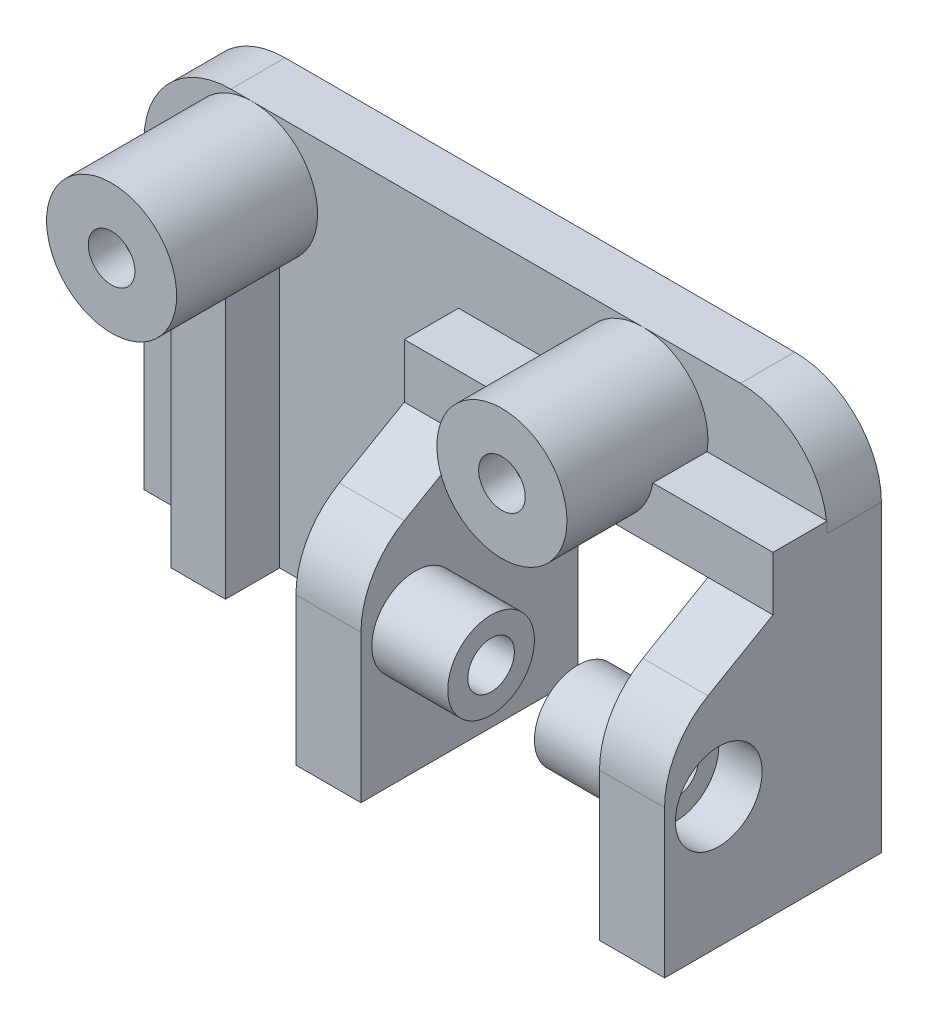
from build123d import *

# Parameters (mm, degrees)
BOSS_EXTRU_1_DEPTH         = 5
ESQUISSE3_R                = 6
BOSS_EXTRU_3_DEPTH         = 13
ESQUISSE4_R                = 4
ENL_V_MAT_EXTRU_1_DEPTH    = 15
ENL_V_MAT_EXTRU_2_REACH    = 76.76
ESQUISSE5_R                = 2.15
BOSS_EXTRU_4_DEPTH         = 6
R_P_TITION_LIN_AIRE1_COUNT = 2
R_P_TITION_LIN_AIRE1_PITCH = 28
BOSS_EXTRU_5_REACH         = 72.321
ESQUISSE7_W                = 5
ESQUISSE7_H                = 5
BOSS_EXTRU_6_REACH         = 56.046
ESQUISSE8_W                = 5
ESQUISSE8_H                = 5
BOSS_EXTRU_7_REACH         = 77.266
BOSS_EXTRU_7_END_RADIUS    = 6
ESQUISSE9_W                = 5
ESQUISSE9_H                = 5
ESQUISSE10_R               = 4
BOSS_EXTRU_8_DEPTH         = 7
BOSS_EXTRU_9_START         = 7
ESQUISSE11_R               = 4
BOSS_EXTRU_9_DEPTH         = 7
ESQUISSE12_R               = 4
ENL_V_MAT_EXTRU_3_DEPTH    = 4
ENL_V_MAT_EXTRU_4_DEPTH    = 4
ENL_V_MAT_EXTRU_5_REACH    = 73.951
ESQUISSE14_R               = 2.15


with BuildPart() as part:
    # Esquisse1 → Boss.-Extru.1 (new body)
    with BuildSketch(Plane.XY):
        with BuildLine():
            Line((57, 0), (63, 0))
            Line((63, 0), (63, 28))
            ThreePointArc((63, 28), (60.656854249, 33.656854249), (55, 36))
            Line((55, 36), (8, 36))
            ThreePointArc((8, 36), (2.343145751, 33.656854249), (0, 28))
            Line((0, 28), (0, 0))
            Line((0, 0), (35, 0))
            Line((35, 0), (35, 24))
            Line((35, 24), (57, 24))
            Line((57, 24), (57, 0))
        make_face()
    extrude(amount=BOSS_EXTRU_1_DEPTH)

    # Esquisse3 → Boss.-Extru.3 (add)
    with BuildSketch(Plane.XY.offset(5)):
        with Locations(Location((10, 30, 0), (0, 0, 90))):
            Circle(ESQUISSE3_R)
        with Locations(Location((46, 30, 0), (0, 0, 270))):
            Circle(ESQUISSE3_R)
    extrude(amount=BOSS_EXTRU_3_DEPTH)

    # Esquisse4 → Enl_v. mat.-Extru.1 (cut)
    with BuildSketch(Plane(origin=(0, 0, 0), x_dir=(-1, 0, 0), z_dir=(0, 0, -1))):
        with Locations((-46, 30)):
            Circle(ESQUISSE4_R)
        with Locations((-10, 30)):
            Circle(ESQUISSE4_R)
    extrude(amount=-ENL_V_MAT_EXTRU_1_DEPTH, mode=Mode.SUBTRACT)

    # Esquisse5 → Enl_v. mat.-Extru.2 (cut, up to next)
    with BuildSketch(Plane.XY.offset(18), mode=Mode.PRIVATE) as enl_v_mat_extru_2_sk1:
        with Locations((10, 30)):
            Circle(ESQUISSE5_R)
    enl_v_mat_extru_2_tool1 = extrude(enl_v_mat_extru_2_sk1.sketch, amount=-ENL_V_MAT_EXTRU_2_REACH, mode=Mode.PRIVATE) & part.part
    # Esquisse5 → Enl_v. mat.-Extru.2 (cut, up to next)
    with BuildSketch(Plane.XY.offset(18), mode=Mode.PRIVATE) as enl_v_mat_extru_2_sk2:
        with Locations((46, 30)):
            Circle(ESQUISSE5_R)
    enl_v_mat_extru_2_tool2 = extrude(enl_v_mat_extru_2_sk2.sketch, amount=-ENL_V_MAT_EXTRU_2_REACH, mode=Mode.PRIVATE) & part.part
    add(enl_v_mat_extru_2_tool1.solids().sort_by_distance((10, 30, 18))[0], mode=Mode.SUBTRACT)
    add(enl_v_mat_extru_2_tool2.solids().sort_by_distance((46, 30, 18))[0], mode=Mode.SUBTRACT)

    # Esquisse7 → Boss.-Extru.5 (add, up to next)
    with BuildSketch(Plane.ZY.offset(-57), mode=Mode.PRIVATE) as boss_extru_5_sk1:
        with Locations((7.5, 26.5)):
            Rectangle(ESQUISSE7_W, ESQUISSE7_H)
    boss_extru_5_tool1 = extrude(boss_extru_5_sk1.sketch, amount=BOSS_EXTRU_5_REACH, mode=Mode.PRIVATE) - part.part


with BuildPart() as body_2:
    # Esquisse6 → Boss.-Extru.4 (new body)
    with BuildSketch(Plane(origin=(63, 0, 0), x_dir=(0, 0, -1), z_dir=(1, 0, 0))):
        with BuildLine():
            Line((-10, 24), (-16, 20.535898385))
            ThreePointArc((-16, 20.535898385), (-18.92820323, 17.607695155), (-20, 13.607695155))
            Line((-20, 13.607695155), (-20, 0))
            Line((-20, 0), (-5, 0))
            Line((-5, 0), (-5, 29))
            Line((-5, 29), (-10, 29))
            Line((-10, 29), (-10, 24))
        make_face()
    boss_extru_4 = extrude(amount=-BOSS_EXTRU_4_DEPTH)


with BuildPart() as r_p_tition_lin_aire1_1:
    # R_p_tition lin_aire1: Boss.-Extru.4 ×2
    with Locations(*[(-i * R_P_TITION_LIN_AIRE1_PITCH, 0, 0) for i in range(1, R_P_TITION_LIN_AIRE1_COUNT)]):
        add(boss_extru_4)


with BuildPart() as part_1:
    add(part.part)

    add(body_2.part)  # Boss.-Extru.5 merges body 2
    add(boss_extru_5_tool1.solids().sort_by_distance((57, 26.5, 7.5))[0])

    # Esquisse8 → Boss.-Extru.6 (add, up to next)
    with BuildSketch(Plane(origin=(35, 0, 0), x_dir=(0, 0, -1), z_dir=(1, 0, 0)), mode=Mode.PRIVATE) as boss_extru_6_sk1:
        with Locations((-7.5, 26.5)):
            Rectangle(ESQUISSE8_W, ESQUISSE8_H)
    boss_extru_6_tool1 = extrude(boss_extru_6_sk1.sketch, amount=BOSS_EXTRU_6_REACH, mode=Mode.PRIVATE) - part_1.part

    add(r_p_tition_lin_aire1_1.part)  # Boss.-Extru.6 merges R_p_tition lin_aire1_1
    add(boss_extru_6_tool1.solids().sort_by_distance((35, 26.5, 7.5))[0])

    # Boss.-Extru.7: up to this cylinder (the profile starts outside it)
    boss_extru_7_end = Plane(origin=(10, 30, 7.5), z_dir=(0, 0, -1)) * Cylinder(BOSS_EXTRU_7_END_RADIUS, 167.532, mode=Mode.PRIVATE)
    # Esquisse9 → Boss.-Extru.7 (add, up to the surface)
    with BuildSketch(Plane.XZ, mode=Mode.PRIVATE) as boss_extru_7_sk1:
        with Locations((10, 7.5)):
            Rectangle(ESQUISSE9_W, ESQUISSE9_H)
    boss_extru_7_tool1 = extrude(boss_extru_7_sk1.sketch, amount=-BOSS_EXTRU_7_REACH, mode=Mode.PRIVATE) - boss_extru_7_end
    add(boss_extru_7_tool1.solids().sort_by_distance((10, 0, 7.5))[0])

    # Esquisse10 → Boss.-Extru.8 (add)
    with BuildSketch(Plane.ZY.offset(-57)):
        with Locations(Location((15, 12, 0), (0, 0, 180))):
            Circle(ESQUISSE10_R)
    extrude(amount=BOSS_EXTRU_8_DEPTH)

    # Esquisse11 → Boss.-Extru.9 (add)
    with BuildSketch(Plane(origin=(35, 0, 0), x_dir=(0, 0, -1), z_dir=(1, 0, 0)).offset(BOSS_EXTRU_9_START)):
        with Locations((-15, 12)):
            Circle(ESQUISSE11_R)
    extrude(amount=-BOSS_EXTRU_9_DEPTH)

    # Esquisse12 → Enl_v. mat.-Extru.3 (cut)
    with BuildSketch(Plane(origin=(63, 0, 0), x_dir=(0, 0, -1), z_dir=(1, 0, 0))):
        with Locations((-15, 12)):
            Circle(ESQUISSE12_R)
    extrude(amount=-ENL_V_MAT_EXTRU_3_DEPTH, mode=Mode.SUBTRACT)

    # Esquisse13 → Enl_v. mat.-Extru.4 (cut)
    with BuildSketch(Plane.ZY.offset(-29)):
        Polygon((19, 9.690598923), (19, 14.309401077), (15, 16.618802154), (11, 14.309401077), (11, 9.690598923), (15, 7.381197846), align=None)
    extrude(amount=-ENL_V_MAT_EXTRU_4_DEPTH, mode=Mode.SUBTRACT)

    # Enl_v. mat.-Extru.5: up to this face of the body (flat: up to its plane)
    enl_v_mat_extru_5_end = Plane(part_1.part.faces().sort_by_distance((33, 12, 15))[0])
    # Esquisse14 → Enl_v. mat.-Extru.5 (cut, up to the picked face)
    with BuildSketch(Plane(origin=(59, 0, 0), x_dir=(0, 0, -1), z_dir=(1, 0, 0)), mode=Mode.PRIVATE) as enl_v_mat_extru_5_sk1:
        with Locations((-15, 12)):
            Circle(ESQUISSE14_R)
    enl_v_mat_extru_5_tool1 = split(extrude(enl_v_mat_extru_5_sk1.sketch, amount=-ENL_V_MAT_EXTRU_5_REACH, mode=Mode.PRIVATE), bisect_by=enl_v_mat_extru_5_end, keep=Keep.BOTH, mode=Mode.PRIVATE)
    add(enl_v_mat_extru_5_tool1.solids().sort_by(Axis((59, 12, 15), (-1, 0, 0)))[0], mode=Mode.SUBTRACT)


solid = part_1.part
